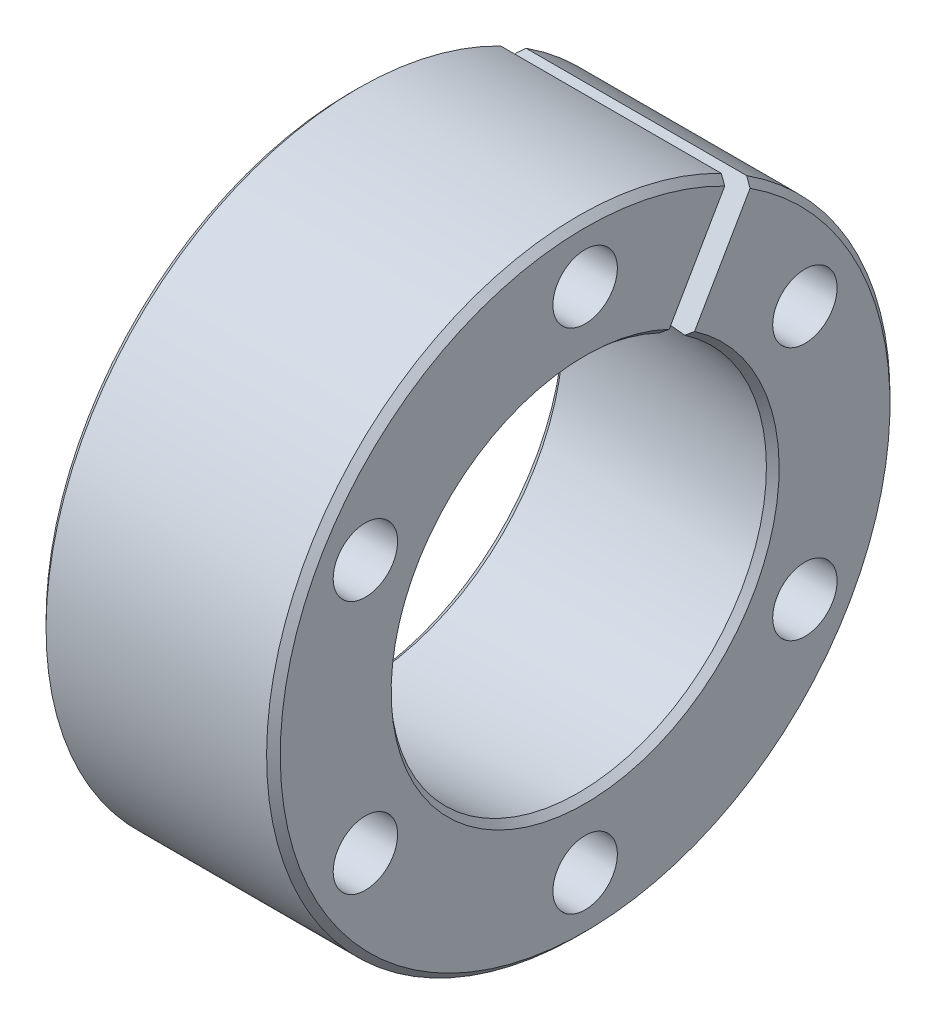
from build123d import *
from OCP.BRepFilletAPI import BRepFilletAPI_MakeChamfer

# Parameters (mm, degrees)
CHAMFER_1_SIZE           = 0.35
CHAMFER_1_SIZE2          = 0.327427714
HOLE_WIZARD_1_D          = 3.3
PATTERN_CIRCULAR_1_COUNT = 6
CUT_EXTRUDE_1_DEPTH      = 26.575022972
CUT_EXTRUDE_1_DEPTH_BACK = 26.575022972
CHAMFER_2_SIZE           = 0.4
CHAMFER_2_SIZE2          = 0.431991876


with BuildPart() as part:
    # Sketch 1 → Revolve 1 (revolve)
    with BuildSketch(Plane.XY, mode=Mode.PRIVATE) as revolve_1_sk:
        Polygon((0, 15.97), (12, 15.97), (12, 9.612286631), (0, 10.472457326), align=None)
    revolve(revolve_1_sk.sketch.rotate(Axis((0, 0, 0), (1, 0, 0)), 90), axis=Axis((0, 0, 0), (1, 0, 0)))

    # Chamfer 1: one chamfer whose edges measure the first distance from different faces: ONE call of the kernel's chamfer builder (chamfer() names one face for all edges)
    chamfer_1_edges_1 = [part.edges().sort_by_distance(p)[0] for p in [
        (12, 0, -9.612286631),
    ]]
    chamfer_1_side_1 = [part.faces().sort_by_distance(p)[0] for p in [
        (6, 0, -10.042371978),
    ]]
    chamfer_1_edges_2 = [part.edges().sort_by_distance(p)[0] for p in [
        (12, 0, -15.97),
        (0, 0, -15.97),
    ]]
    chamfer_1 = BRepFilletAPI_MakeChamfer(part.part.solid().wrapped)
    for e in chamfer_1_edges_1:
        chamfer_1.Add(CHAMFER_1_SIZE, CHAMFER_1_SIZE2, e.wrapped, chamfer_1_side_1[0].wrapped)  # the first distance lies on this face
    for e in chamfer_1_edges_2:
        chamfer_1.Add(CHAMFER_1_SIZE, e.wrapped)
    add(Compound.cast(chamfer_1.Shape()), mode=Mode.REPLACE)

    # Hole Wizard 1 (through all)
    with Locations(Plane.ZY):
        with Locations((0, 13)):
            hole_wizard_1 = Hole(HOLE_WIZARD_1_D / 2)

    # Pattern Circular 1: Hole Wizard 1 ×6 about axis
    pattern_circular_1_axis = Axis((0, 0, 0), (1, 0, 0))
    for i in range(1, PATTERN_CIRCULAR_1_COUNT):
        add(hole_wizard_1.rotate(pattern_circular_1_axis, i * 360 / PATTERN_CIRCULAR_1_COUNT), mode=Mode.SUBTRACT)

    # Sketch 4 → Cut-Extrude 1 (cut, two sides: drawn at the far end of the back side and taken through both)
    with BuildSketch(Plane.ZY.offset(-CUT_EXTRUDE_1_DEPTH_BACK)):
        Polygon((0.649519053, 0.375), (-7.335480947, 14.205425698), (-8.634519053, 13.455425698), (-0.649519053, -0.375), align=None)
    extrude(amount=CUT_EXTRUDE_1_DEPTH + CUT_EXTRUDE_1_DEPTH_BACK, mode=Mode.SUBTRACT)

    # Chamfer 2
    chamfer_2_edges = [part.edges().sort_by_distance(p)[0] for p in [
        (0, -9.25121069, -4.907898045),
    ]]
    chamfer_2_side = [part.faces().sort_by_distance(p)[0] for p in [
        (0, 10.683020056, -7.544016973),
    ]]
    chamfer(chamfer_2_edges, length=CHAMFER_2_SIZE, length2=CHAMFER_2_SIZE2, reference=chamfer_2_side[0])


solid = part.part
